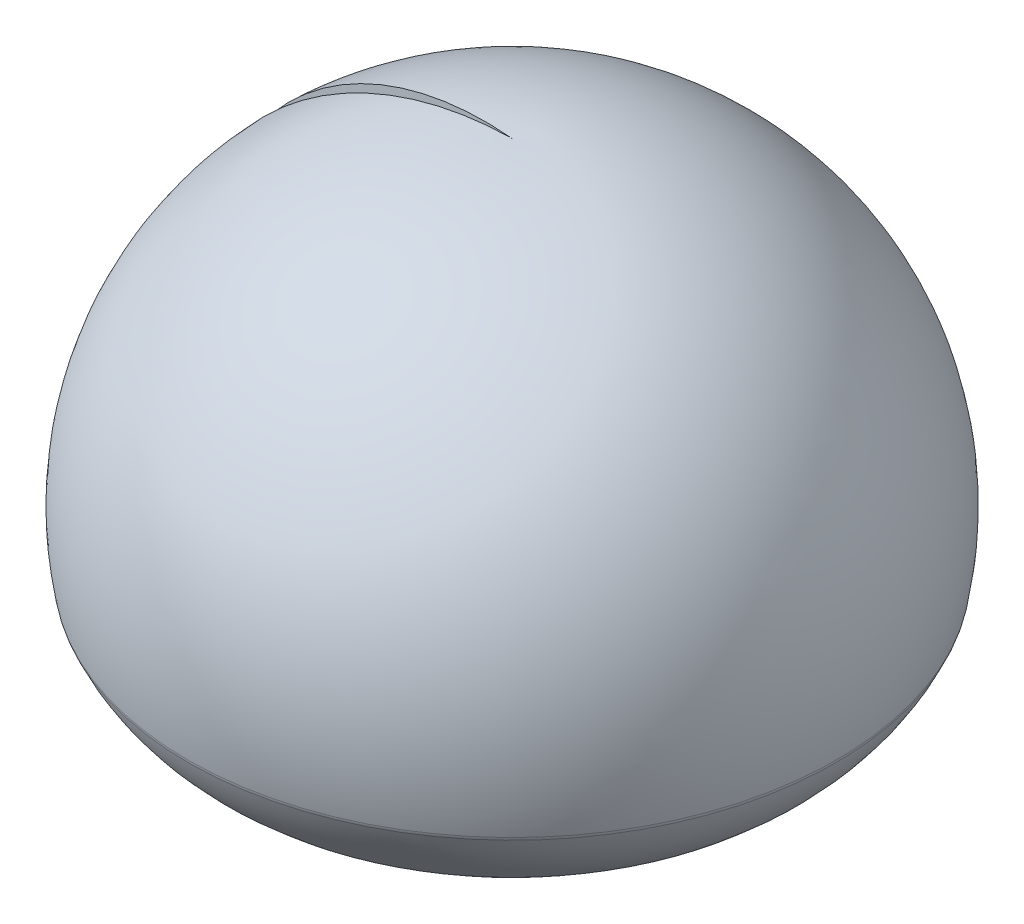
ISO-10303-21;
HEADER;
FILE_DESCRIPTION(('STEP AP214'),'2;1');
FILE_NAME('part.step','',(''),(''),'','','');
FILE_SCHEMA(('AUTOMOTIVE_DESIGN { 1 0 10303 214 1 1 1 1 }'));
ENDSEC;
DATA;
#1=APPLICATION_CONTEXT('core data for automotive mechanical design processes');
#2=APPLICATION_PROTOCOL_DEFINITION('international standard','automotive_design',2000,#1);
#3=PRODUCT_CONTEXT('',#1,'mechanical');
#4=PRODUCT('Part','Part','',(#3));
#5=PRODUCT_RELATED_PRODUCT_CATEGORY('part','',(#4));
#6=PRODUCT_DEFINITION_FORMATION('','',#4);
#7=PRODUCT_DEFINITION_CONTEXT('part definition',#1,'design');
#8=PRODUCT_DEFINITION('design','',#6,#7);
#9=PRODUCT_DEFINITION_SHAPE('','',#8);
#10=(LENGTH_UNIT() NAMED_UNIT(*) SI_UNIT(.MILLI.,.METRE.));
#11=(NAMED_UNIT(*) PLANE_ANGLE_UNIT() SI_UNIT($,.RADIAN.));
#12=(NAMED_UNIT(*) SI_UNIT($,.STERADIAN.) SOLID_ANGLE_UNIT());
#13=UNCERTAINTY_MEASURE_WITH_UNIT(LENGTH_MEASURE(1.E-05),#10,'distance_accuracy_value','');
#14=(GEOMETRIC_REPRESENTATION_CONTEXT(3) GLOBAL_UNCERTAINTY_ASSIGNED_CONTEXT((#13)) GLOBAL_UNIT_ASSIGNED_CONTEXT((#10,
#11,#12)) REPRESENTATION_CONTEXT('',''));
#15=CARTESIAN_POINT('',(0.,0.,0.));
#16=DIRECTION('',(0.,0.,1.));
#17=DIRECTION('',(1.,0.,0.));
#18=AXIS2_PLACEMENT_3D('',#15,#16,#17);
#19=CARTESIAN_POINT('',(0.,567.,-50.));
#20=DIRECTION('',(-1.,0.,0.));
#21=DIRECTION('',(0.,0.,-1.));
#22=AXIS2_PLACEMENT_3D('',#19,#20,#21);
#23=CIRCLE('',#22,1377.85245562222);
#24=TRIMMED_CURVE('',#23,(PARAMETER_VALUE(-1.60709265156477)),
(PARAMETER_VALUE(1.60709265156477)),.T.,.PARAMETER.);
#25=CARTESIAN_POINT('',(0.,567.,0.));
#26=DIRECTION('',(0.,-1.,0.));
#27=AXIS1_PLACEMENT('',#25,#26);
#28=SURFACE_OF_REVOLUTION('',#24,#27);
#29=CARTESIAN_POINT('',(-49.9314767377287,567.,2.61679781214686));
#30=DIRECTION('',(-0.0523359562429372,0.,-0.998629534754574));
#31=DIRECTION('',(-0.998629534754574,0.,0.0523359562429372));
#32=AXIS2_PLACEMENT_3D('',#29,#30,#31);
#33=CIRCLE('',#32,1377.85245562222);
#34=CARTESIAN_POINT('',(-1402.61992629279,314.639627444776,73.5081955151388));
#35=VERTEX_POINT('',#34);
#36=CARTESIAN_POINT('',(0.,1943.9449478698,0.));
#37=VERTEX_POINT('',#36);
#38=EDGE_CURVE('E113',#35,#37,#33,.T.);
#39=ORIENTED_EDGE('',*,*,#38,.F.);
#40=CARTESIAN_POINT('',(0.,314.639627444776,0.));
#41=DIRECTION('',(0.,-1.,0.));
#42=DIRECTION('',(0.,0.,-1.));
#43=AXIS2_PLACEMENT_3D('',#40,#41,#42);
#44=CIRCLE('',#43,1404.54480613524);
#45=CARTESIAN_POINT('',(-1402.61992629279,314.639627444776,-73.5081955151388));
#46=VERTEX_POINT('',#45);
#47=EDGE_CURVE('E52',#46,#35,#44,.T.);
#48=ORIENTED_EDGE('',*,*,#47,.F.);
#49=CARTESIAN_POINT('',(-49.9314767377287,567.,-2.61679781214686));
#50=DIRECTION('',(0.0523359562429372,0.,-0.998629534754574));
#51=DIRECTION('',(-0.998629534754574,0.,-0.0523359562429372));
#52=AXIS2_PLACEMENT_3D('',#49,#50,#51);
#53=CIRCLE('',#52,1377.85245562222);
#54=EDGE_CURVE('E130',#46,#37,#53,.T.);
#55=ORIENTED_EDGE('',*,*,#54,.T.);
#56=EDGE_LOOP('',(#39,#48,#55));
#57=FACE_BOUND('',#56,.T.);
#58=ADVANCED_FACE('F37',(#57),#28,.T.);
#59=CARTESIAN_POINT('',(0.,1897.46524182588,0.));
#60=DIRECTION('',(0.,-1.,0.));
#61=DIRECTION('',(0.,0.,-1.));
#62=AXIS2_PLACEMENT_3D('',#59,#60,#61);
#63=CONICAL_SURFACE('',#62,0.,0.840437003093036);
#64=CARTESIAN_POINT('',(0.,1841.07066356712,0.));
#65=DIRECTION('',(0.,-1.,0.));
#66=DIRECTION('',(0.,0.,-1.));
#67=AXIS2_PLACEMENT_3D('',#64,#65,#66);
#68=CIRCLE('',#67,62.9709609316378);
#69=CARTESIAN_POINT('',(-62.8846614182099,1841.07066356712,-3.2956454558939));
#70=VERTEX_POINT('',#69);
#71=CARTESIAN_POINT('',(-62.8846614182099,1841.07066356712,3.2956454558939));
#72=VERTEX_POINT('',#71);
#73=EDGE_CURVE('E11',#70,#72,#68,.T.);
#74=ORIENTED_EDGE('',*,*,#73,.T.);
#75=DIRECTION('',(-0.743913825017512,-0.667137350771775,0.0389868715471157));
#76=VECTOR('',#75,1.);
#77=CARTESIAN_POINT('',(-62.8846614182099,1841.07066356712,3.2956454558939));
#78=LINE('',#77,#76);
#79=CARTESIAN_POINT('',(0.,1897.46524182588,0.));
#80=VERTEX_POINT('',#79);
#81=EDGE_CURVE('E97',#80,#72,#78,.T.);
#82=ORIENTED_EDGE('',*,*,#81,.F.);
#83=DIRECTION('',(-0.743913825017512,-0.667137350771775,-0.0389868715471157));
#84=VECTOR('',#83,1.);
#85=CARTESIAN_POINT('',(-62.8846614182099,1841.07066356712,-3.2956454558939));
#86=LINE('',#85,#84);
#87=EDGE_CURVE('E100',#80,#70,#86,.T.);
#88=ORIENTED_EDGE('',*,*,#87,.T.);
#89=EDGE_LOOP('',(#74,#82,#88));
#90=FACE_BOUND('',#89,.T.);
#91=ADVANCED_FACE('F39',(#90),#63,.F.);
#92=CARTESIAN_POINT('',(0.,1175.47865352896,0.));
#93=DIRECTION('',(0.,-1.,0.));
#94=DIRECTION('',(0.,0.,-1.));
#95=AXIS2_PLACEMENT_3D('',#92,#93,#94);
#96=DEGENERATE_TOROIDAL_SURFACE('',#95,124.478446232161,691.483914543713,.F.);
#97=CARTESIAN_POINT('',(0.,742.863047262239,0.));
#98=DIRECTION('',(0.,-1.,0.));
#99=DIRECTION('',(0.,0.,-1.));
#100=AXIS2_PLACEMENT_3D('',#97,#98,#99);
#101=CIRCLE('',#100,414.959911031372);
#102=CARTESIAN_POINT('',(-414.391222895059,742.863047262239,-21.717323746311));
#103=VERTEX_POINT('',#102);
#104=CARTESIAN_POINT('',(-414.391222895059,742.863047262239,21.717323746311));
#105=VERTEX_POINT('',#104);
#106=EDGE_CURVE('E45',#103,#105,#101,.T.);
#107=ORIENTED_EDGE('',*,*,#106,.T.);
#108=CARTESIAN_POINT('',(124.307852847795,1175.47865352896,-6.51469851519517));
#109=DIRECTION('',(0.0523359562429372,0.,0.998629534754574));
#110=DIRECTION('',(-0.998629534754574,0.,0.0523359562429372));
#111=AXIS2_PLACEMENT_3D('',#108,#109,#110);
#112=CIRCLE('',#111,691.483914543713);
#113=EDGE_CURVE('E110',#72,#105,#112,.T.);
#114=ORIENTED_EDGE('',*,*,#113,.F.);
#115=ORIENTED_EDGE('',*,*,#73,.F.);
#116=CARTESIAN_POINT('',(124.307852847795,1175.47865352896,6.51469851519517));
#117=DIRECTION('',(-0.0523359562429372,0.,0.998629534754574));
#118=DIRECTION('',(-0.998629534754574,0.,-0.0523359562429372));
#119=AXIS2_PLACEMENT_3D('',#116,#117,#118);
#120=CIRCLE('',#119,691.483914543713);
#121=EDGE_CURVE('E134',#70,#103,#120,.T.);
#122=ORIENTED_EDGE('',*,*,#121,.T.);
#123=EDGE_LOOP('',(#107,#114,#115,#122));
#124=FACE_BOUND('',#123,.T.);
#125=ADVANCED_FACE('F115',(#124),#96,.T.);
#126=CARTESIAN_POINT('',(0.,567.,0.));
#127=DIRECTION('',(0.,-1.,0.));
#128=DIRECTION('',(0.,0.,-1.));
#129=AXIS2_PLACEMENT_3D('',#126,#127,#128);
#130=DEGENERATE_TOROIDAL_SURFACE('',#129,50.,405.121645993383,.T.);
#131=CARTESIAN_POINT('',(0.,173.196852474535,0.));
#132=DIRECTION('',(0.,-1.,0.));
#133=DIRECTION('',(0.,0.,-1.));
#134=AXIS2_PLACEMENT_3D('',#131,#132,#133);
#135=CIRCLE('',#134,145.092739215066);
#136=CARTESIAN_POINT('',(-144.893894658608,173.196852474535,-7.59356725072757));
#137=VERTEX_POINT('',#136);
#138=CARTESIAN_POINT('',(-144.893894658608,173.196852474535,7.59356725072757));
#139=VERTEX_POINT('',#138);
#140=EDGE_CURVE('E150',#137,#139,#135,.T.);
#141=ORIENTED_EDGE('',*,*,#140,.T.);
#142=CARTESIAN_POINT('',(-49.9314767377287,567.,2.61679781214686));
#143=DIRECTION('',(0.0523359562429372,0.,0.998629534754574));
#144=DIRECTION('',(-0.998629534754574,0.,0.0523359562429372));
#145=AXIS2_PLACEMENT_3D('',#142,#143,#144);
#146=CIRCLE('',#145,405.121645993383);
#147=EDGE_CURVE('E116',#105,#139,#146,.T.);
#148=ORIENTED_EDGE('',*,*,#147,.F.);
#149=ORIENTED_EDGE('',*,*,#106,.F.);
#150=CARTESIAN_POINT('',(-49.9314767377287,567.,-2.61679781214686));
#151=DIRECTION('',(-0.0523359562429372,0.,0.998629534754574));
#152=DIRECTION('',(-0.998629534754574,0.,-0.0523359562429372));
#153=AXIS2_PLACEMENT_3D('',#150,#151,#152);
#154=CIRCLE('',#153,405.121645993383);
#155=EDGE_CURVE('E136',#103,#137,#154,.T.);
#156=ORIENTED_EDGE('',*,*,#155,.T.);
#157=EDGE_LOOP('',(#141,#148,#149,#156));
#158=FACE_BOUND('',#157,.T.);
#159=ADVANCED_FACE('F152',(#158),#130,.F.);
#160=CARTESIAN_POINT('',(0.,113.077991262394,0.));
#161=DIRECTION('',(0.,-1.,0.));
#162=DIRECTION('',(0.,0.,-1.));
#163=AXIS2_PLACEMENT_3D('',#160,#161,#162);
#164=TOROIDAL_SURFACE('',#163,160.24933931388,61.9999999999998);
#165=CARTESIAN_POINT('',(0.,70.2432817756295,0.));
#166=DIRECTION('',(0.,-1.,0.));
#167=DIRECTION('',(0.,0.,-1.));
#168=AXIS2_PLACEMENT_3D('',#165,#166,#167);
#169=CIRCLE('',#168,115.425376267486);
#170=CARTESIAN_POINT('',(-115.267189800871,70.2432817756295,-6.0408974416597));
#171=VERTEX_POINT('',#170);
#172=CARTESIAN_POINT('',(-115.267189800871,70.2432817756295,6.0408974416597));
#173=VERTEX_POINT('',#172);
#174=EDGE_CURVE('E148',#171,#173,#169,.T.);
#175=ORIENTED_EDGE('',*,*,#174,.T.);
#176=CARTESIAN_POINT('',(-160.029723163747,113.077991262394,8.38680241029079));
#177=DIRECTION('',(-0.0523359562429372,0.,-0.998629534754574));
#178=DIRECTION('',(-0.998629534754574,0.,0.0523359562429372));
#179=AXIS2_PLACEMENT_3D('',#176,#177,#178);
#180=CIRCLE('',#179,61.9999999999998);
#181=EDGE_CURVE('E118',#139,#173,#180,.T.);
#182=ORIENTED_EDGE('',*,*,#181,.F.);
#183=ORIENTED_EDGE('',*,*,#140,.F.);
#184=CARTESIAN_POINT('',(-160.029723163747,113.077991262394,-8.38680241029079));
#185=DIRECTION('',(0.0523359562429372,0.,-0.998629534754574));
#186=DIRECTION('',(-0.998629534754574,0.,-0.0523359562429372));
#187=AXIS2_PLACEMENT_3D('',#184,#185,#186);
#188=CIRCLE('',#187,61.9999999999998);
#189=EDGE_CURVE('E139',#137,#171,#188,.T.);
#190=ORIENTED_EDGE('',*,*,#189,.T.);
#191=EDGE_LOOP('',(#175,#182,#183,#190));
#192=FACE_BOUND('',#191,.T.);
#193=ADVANCED_FACE('F158',(#192),#164,.T.);
#194=CARTESIAN_POINT('',(0.,611.155847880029,0.));
#195=DIRECTION('',(0.,-1.,0.));
#196=DIRECTION('',(0.,0.,-1.));
#197=AXIS2_PLACEMENT_3D('',#194,#195,#196);
#198=DEGENERATE_TOROIDAL_SURFACE('',#197,681.458043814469,782.93,.T.);
#199=CARTESIAN_POINT('',(0.,301.471407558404,0.));
#200=DIRECTION('',(0.,-1.,0.));
#201=DIRECTION('',(0.,0.,-1.));
#202=AXIS2_PLACEMENT_3D('',#199,#200,#201);
#203=CIRCLE('',#202,1400.53726915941);
#204=CARTESIAN_POINT('',(-1398.6178815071,301.471407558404,-73.2984572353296));
#205=VERTEX_POINT('',#204);
#206=CARTESIAN_POINT('',(-1398.6178815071,301.471407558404,73.2984572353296));
#207=VERTEX_POINT('',#206);
#208=EDGE_CURVE('E60',#205,#207,#203,.T.);
#209=ORIENTED_EDGE('',*,*,#208,.T.);
#210=CARTESIAN_POINT('',(-680.524129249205,611.155847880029,35.6647583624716));
#211=DIRECTION('',(-0.0523359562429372,0.,-0.998629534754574));
#212=DIRECTION('',(-0.998629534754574,0.,0.0523359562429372));
#213=AXIS2_PLACEMENT_3D('',#210,#211,#212);
#214=CIRCLE('',#213,782.93);
#215=EDGE_CURVE('E124',#173,#207,#214,.T.);
#216=ORIENTED_EDGE('',*,*,#215,.F.);
#217=ORIENTED_EDGE('',*,*,#174,.F.);
#218=CARTESIAN_POINT('',(-680.524129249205,611.155847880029,-35.6647583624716));
#219=DIRECTION('',(0.0523359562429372,0.,-0.998629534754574));
#220=DIRECTION('',(-0.998629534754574,0.,-0.0523359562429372));
#221=AXIS2_PLACEMENT_3D('',#218,#219,#220);
#222=CIRCLE('',#221,782.93);
#223=EDGE_CURVE('E142',#171,#205,#222,.T.);
#224=ORIENTED_EDGE('',*,*,#223,.T.);
#225=EDGE_LOOP('',(#209,#216,#217,#224));
#226=FACE_BOUND('',#225,.T.);
#227=ADVANCED_FACE('F161',(#226),#198,.T.);
#228=CARTESIAN_POINT('',(0.,325.995228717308,0.));
#229=DIRECTION('',(0.,-1.,0.));
#230=DIRECTION('',(0.,0.,-1.));
#231=AXIS2_PLACEMENT_3D('',#228,#229,#230);
#232=TOROIDAL_SURFACE('',#231,1343.59359351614,62.);
#233=CARTESIAN_POINT('',(-1341.75224519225,325.995228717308,-70.3182555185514));
#234=DIRECTION('',(0.0523359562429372,0.,-0.998629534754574));
#235=DIRECTION('',(-0.998629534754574,0.,-0.0523359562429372));
#236=AXIS2_PLACEMENT_3D('',#233,#234,#235);
#237=CIRCLE('',#236,62.);
#238=EDGE_CURVE('E144',#205,#46,#237,.T.);
#239=ORIENTED_EDGE('',*,*,#238,.T.);
#240=ORIENTED_EDGE('',*,*,#47,.T.);
#241=CARTESIAN_POINT('',(-1341.75224519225,325.995228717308,70.3182555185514));
#242=DIRECTION('',(-0.0523359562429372,0.,-0.998629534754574));
#243=DIRECTION('',(-0.998629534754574,0.,0.0523359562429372));
#244=AXIS2_PLACEMENT_3D('',#241,#242,#243);
#245=CIRCLE('',#244,62.);
#246=EDGE_CURVE('E127',#207,#35,#245,.T.);
#247=ORIENTED_EDGE('',*,*,#246,.F.);
#248=ORIENTED_EDGE('',*,*,#208,.F.);
#249=EDGE_LOOP('',(#239,#240,#247,#248));
#250=FACE_BOUND('',#249,.T.);
#251=ADVANCED_FACE('F163',(#250),#232,.T.);
#252=CARTESIAN_POINT('',(-49.9314767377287,567.,-2.61679781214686));
#253=DIRECTION('',(0.0523359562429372,0.,-0.998629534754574));
#254=DIRECTION('',(-0.998629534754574,0.,-0.0523359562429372));
#255=AXIS2_PLACEMENT_3D('',#252,#253,#254);
#256=PLANE('',#255);
#257=ORIENTED_EDGE('',*,*,#54,.F.);
#258=ORIENTED_EDGE('',*,*,#238,.F.);
#259=ORIENTED_EDGE('',*,*,#223,.F.);
#260=ORIENTED_EDGE('',*,*,#189,.F.);
#261=ORIENTED_EDGE('',*,*,#155,.F.);
#262=ORIENTED_EDGE('',*,*,#121,.F.);
#263=ORIENTED_EDGE('',*,*,#87,.F.);
#264=DIRECTION('',(0.,-1.,0.));
#265=VECTOR('',#264,1.);
#266=CARTESIAN_POINT('',(0.,1897.46524182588,0.));
#267=LINE('',#266,#265);
#268=EDGE_CURVE('E112',#37,#80,#267,.T.);
#269=ORIENTED_EDGE('',*,*,#268,.F.);
#270=EDGE_LOOP('',(#257,#258,#259,#260,#261,#262,#263,#269));
#271=FACE_BOUND('',#270,.T.);
#272=ADVANCED_FACE('F165',(#271),#256,.F.);
#273=CARTESIAN_POINT('',(-49.9314767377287,567.,2.61679781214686));
#274=DIRECTION('',(-0.0523359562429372,0.,-0.998629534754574));
#275=DIRECTION('',(-0.998629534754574,0.,0.0523359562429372));
#276=AXIS2_PLACEMENT_3D('',#273,#274,#275);
#277=PLANE('',#276);
#278=ORIENTED_EDGE('',*,*,#38,.T.);
#279=ORIENTED_EDGE('',*,*,#268,.T.);
#280=ORIENTED_EDGE('',*,*,#81,.T.);
#281=ORIENTED_EDGE('',*,*,#113,.T.);
#282=ORIENTED_EDGE('',*,*,#147,.T.);
#283=ORIENTED_EDGE('',*,*,#181,.T.);
#284=ORIENTED_EDGE('',*,*,#215,.T.);
#285=ORIENTED_EDGE('',*,*,#246,.T.);
#286=EDGE_LOOP('',(#278,#279,#280,#281,#282,#283,#284,#285));
#287=FACE_BOUND('',#286,.T.);
#288=ADVANCED_FACE('F108',(#287),#277,.T.);
#289=CLOSED_SHELL('',(#58,#91,#125,#159,#193,#227,#251,#272,#288));
#290=MANIFOLD_SOLID_BREP('B2',#289);
#291=ADVANCED_BREP_SHAPE_REPRESENTATION('',(#18,#290),#14);
#292=SHAPE_DEFINITION_REPRESENTATION(#9,#291);
ENDSEC;
END-ISO-10303-21;
